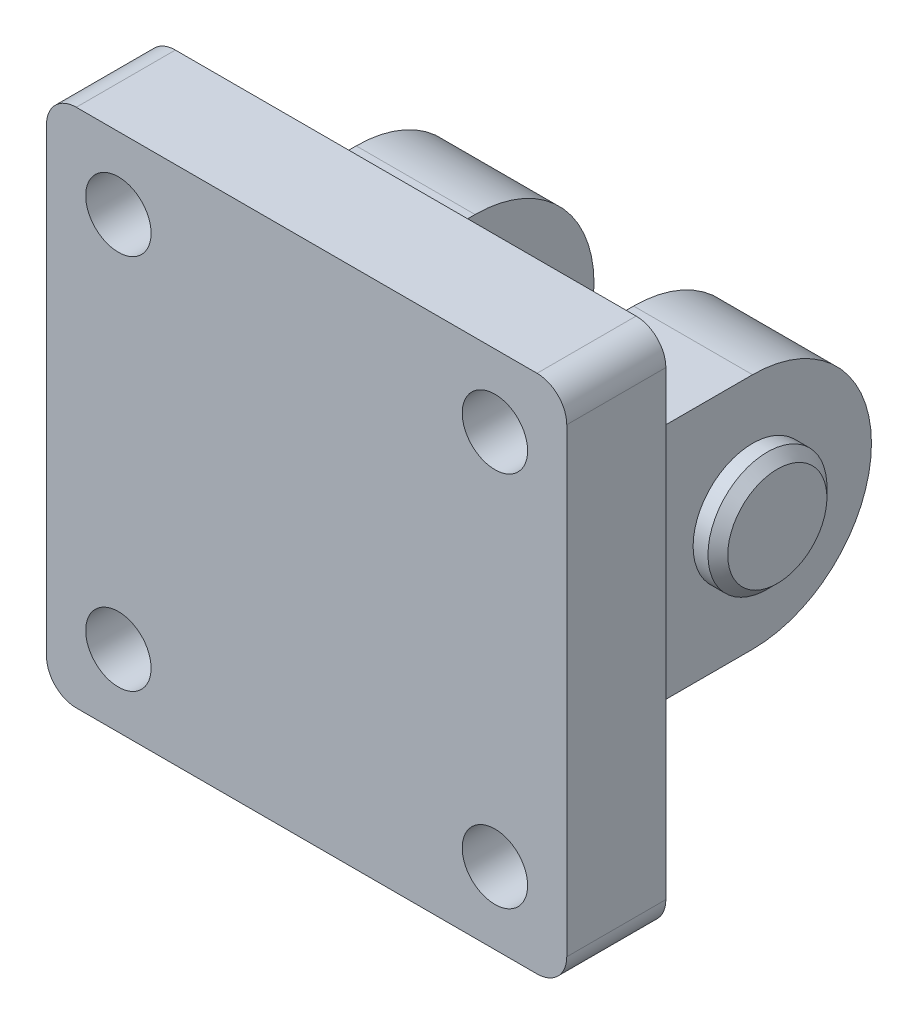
ISO-10303-21;
HEADER;
FILE_DESCRIPTION(('STEP AP214'),'2;1');
FILE_NAME('part.step','',(''),(''),'','','');
FILE_SCHEMA(('AUTOMOTIVE_DESIGN { 1 0 10303 214 1 1 1 1 }'));
ENDSEC;
DATA;
#1=APPLICATION_CONTEXT('core data for automotive mechanical design processes');
#2=APPLICATION_PROTOCOL_DEFINITION('international standard','automotive_design',2000,#1);
#3=PRODUCT_CONTEXT('',#1,'mechanical');
#4=PRODUCT('Part','Part','',(#3));
#5=PRODUCT_RELATED_PRODUCT_CATEGORY('part','',(#4));
#6=PRODUCT_DEFINITION_FORMATION('','',#4);
#7=PRODUCT_DEFINITION_CONTEXT('part definition',#1,'design');
#8=PRODUCT_DEFINITION('design','',#6,#7);
#9=PRODUCT_DEFINITION_SHAPE('','',#8);
#10=(LENGTH_UNIT() NAMED_UNIT(*) SI_UNIT(.MILLI.,.METRE.));
#11=(NAMED_UNIT(*) PLANE_ANGLE_UNIT() SI_UNIT($,.RADIAN.));
#12=(NAMED_UNIT(*) SI_UNIT($,.STERADIAN.) SOLID_ANGLE_UNIT());
#13=UNCERTAINTY_MEASURE_WITH_UNIT(LENGTH_MEASURE(1.E-05),#10,'distance_accuracy_value','');
#14=(GEOMETRIC_REPRESENTATION_CONTEXT(3) GLOBAL_UNCERTAINTY_ASSIGNED_CONTEXT((#13)) GLOBAL_UNIT_ASSIGNED_CONTEXT((#10,
#11,#12)) REPRESENTATION_CONTEXT('',''));
#15=CARTESIAN_POINT('',(0.,0.,0.));
#16=DIRECTION('',(0.,0.,1.));
#17=DIRECTION('',(1.,0.,0.));
#18=AXIS2_PLACEMENT_3D('',#15,#16,#17);
#19=CARTESIAN_POINT('',(22.5,0.,-25.));
#20=DIRECTION('',(1.,0.,0.));
#21=DIRECTION('',(0.,0.,-1.));
#22=AXIS2_PLACEMENT_3D('',#19,#20,#21);
#23=PLANE('',#22);
#24=CARTESIAN_POINT('',(22.4999999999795,0.,-25.));
#25=DIRECTION('',(-1.,0.,0.));
#26=DIRECTION('',(0.,0.,1.));
#27=AXIS2_PLACEMENT_3D('',#24,#25,#26);
#28=CIRCLE('',#27,5.00000000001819);
#29=CARTESIAN_POINT('',(22.4999999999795,0.,-19.9999999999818));
#30=VERTEX_POINT('',#29);
#31=EDGE_CURVE('E20',#30,#30,#28,.T.);
#32=ORIENTED_EDGE('',*,*,#31,.F.);
#33=EDGE_LOOP('',(#32));
#34=FACE_BOUND('',#33,.T.);
#35=ADVANCED_FACE('F16',(#34),#23,.T.);
#36=CARTESIAN_POINT('',(-22.5,0.,-25.));
#37=DIRECTION('',(1.,0.,0.));
#38=DIRECTION('',(0.,0.,-1.));
#39=AXIS2_PLACEMENT_3D('',#36,#37,#38);
#40=PLANE('',#39);
#41=CARTESIAN_POINT('',(-22.4999999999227,0.,-25.));
#42=DIRECTION('',(1.,0.,0.));
#43=DIRECTION('',(0.,0.,-1.));
#44=AXIS2_PLACEMENT_3D('',#41,#42,#43);
#45=CIRCLE('',#44,5.00000000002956);
#46=CARTESIAN_POINT('',(-22.4999999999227,0.,-30.0000000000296));
#47=VERTEX_POINT('',#46);
#48=EDGE_CURVE('E299',#47,#47,#45,.T.);
#49=ORIENTED_EDGE('',*,*,#48,.F.);
#50=EDGE_LOOP('',(#49));
#51=FACE_BOUND('',#50,.T.);
#52=ADVANCED_FACE('F377',(#51),#40,.F.);
#53=CARTESIAN_POINT('',(21.5000000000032,0.,-25.));
#54=DIRECTION('',(-1.,0.,0.));
#55=DIRECTION('',(0.,0.,1.));
#56=AXIS2_PLACEMENT_3D('',#53,#54,#55);
#57=CONICAL_SURFACE('',#56,6.00000000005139,0.78539816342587);
#58=ORIENTED_EDGE('',*,*,#31,.T.);
#59=EDGE_LOOP('',(#58));
#60=FACE_BOUND('',#59,.T.);
#61=CARTESIAN_POINT('',(21.5,0.,-25.));
#62=DIRECTION('',(-1.,0.,0.));
#63=DIRECTION('',(0.,0.,1.));
#64=AXIS2_PLACEMENT_3D('',#61,#62,#63);
#65=CIRCLE('',#64,6.);
#66=CARTESIAN_POINT('',(21.5,0.,-19.));
#67=VERTEX_POINT('',#66);
#68=EDGE_CURVE('E297',#67,#67,#65,.T.);
#69=ORIENTED_EDGE('',*,*,#68,.F.);
#70=EDGE_LOOP('',(#69));
#71=FACE_BOUND('',#70,.T.);
#72=ADVANCED_FACE('F373',(#60,#71),#57,.T.);
#73=CARTESIAN_POINT('',(-21.5000000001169,0.,-25.));
#74=DIRECTION('',(1.,0.,0.));
#75=DIRECTION('',(0.,0.,-1.));
#76=AXIS2_PLACEMENT_3D('',#73,#74,#75);
#77=CONICAL_SURFACE('',#76,5.99999999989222,0.78539816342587);
#78=CARTESIAN_POINT('',(-21.5,0.,-25.));
#79=DIRECTION('',(-1.,0.,0.));
#80=DIRECTION('',(0.,0.,1.));
#81=AXIS2_PLACEMENT_3D('',#78,#79,#80);
#82=CIRCLE('',#81,6.);
#83=CARTESIAN_POINT('',(-21.5,0.,-19.));
#84=VERTEX_POINT('',#83);
#85=EDGE_CURVE('E283',#84,#84,#82,.F.);
#86=ORIENTED_EDGE('',*,*,#85,.F.);
#87=EDGE_LOOP('',(#86));
#88=FACE_BOUND('',#87,.T.);
#89=ORIENTED_EDGE('',*,*,#48,.T.);
#90=EDGE_LOOP('',(#89));
#91=FACE_BOUND('',#90,.T.);
#92=ADVANCED_FACE('F735',(#88,#91),#77,.T.);
#93=CARTESIAN_POINT('',(22.5,0.,-25.));
#94=DIRECTION('',(-1.,0.,0.));
#95=DIRECTION('',(0.,0.,1.));
#96=AXIS2_PLACEMENT_3D('',#93,#94,#95);
#97=CYLINDRICAL_SURFACE('',#96,6.);
#98=CARTESIAN_POINT('',(8.,0.,-25.));
#99=DIRECTION('',(-1.,0.,0.));
#100=DIRECTION('',(0.,0.,1.));
#101=AXIS2_PLACEMENT_3D('',#98,#99,#100);
#102=CIRCLE('',#101,6.);
#103=CARTESIAN_POINT('',(8.,0.,-19.));
#104=VERTEX_POINT('',#103);
#105=EDGE_CURVE('E250',#104,#104,#102,.F.);
#106=ORIENTED_EDGE('',*,*,#105,.F.);
#107=EDGE_LOOP('',(#106));
#108=FACE_BOUND('',#107,.T.);
#109=CARTESIAN_POINT('',(-8.,0.,-25.));
#110=DIRECTION('',(-1.,0.,0.));
#111=DIRECTION('',(0.,0.,1.));
#112=AXIS2_PLACEMENT_3D('',#109,#110,#111);
#113=CIRCLE('',#112,6.);
#114=CARTESIAN_POINT('',(-8.,0.,-19.));
#115=VERTEX_POINT('',#114);
#116=EDGE_CURVE('E286',#115,#115,#113,.T.);
#117=ORIENTED_EDGE('',*,*,#116,.F.);
#118=EDGE_LOOP('',(#117));
#119=FACE_BOUND('',#118,.T.);
#120=ADVANCED_FACE('F727',(#108,#119),#97,.T.);
#121=CARTESIAN_POINT('',(22.5,0.,-25.));
#122=DIRECTION('',(-1.,0.,0.));
#123=DIRECTION('',(0.,0.,1.));
#124=AXIS2_PLACEMENT_3D('',#121,#122,#123);
#125=CYLINDRICAL_SURFACE('',#124,6.);
#126=ORIENTED_EDGE('',*,*,#68,.T.);
#127=EDGE_LOOP('',(#126));
#128=FACE_BOUND('',#127,.T.);
#129=CARTESIAN_POINT('',(20.,0.,-25.));
#130=DIRECTION('',(-1.,0.,0.));
#131=DIRECTION('',(0.,0.,1.));
#132=AXIS2_PLACEMENT_3D('',#129,#130,#131);
#133=CIRCLE('',#132,6.);
#134=CARTESIAN_POINT('',(20.,0.,-19.));
#135=VERTEX_POINT('',#134);
#136=EDGE_CURVE('E255',#135,#135,#133,.F.);
#137=ORIENTED_EDGE('',*,*,#136,.T.);
#138=EDGE_LOOP('',(#137));
#139=FACE_BOUND('',#138,.T.);
#140=ADVANCED_FACE('F720',(#128,#139),#125,.T.);
#141=CARTESIAN_POINT('',(20.,-12.,-10.));
#142=DIRECTION('',(0.,0.,-1.));
#143=DIRECTION('',(0.,1.,0.));
#144=AXIS2_PLACEMENT_3D('',#141,#142,#143);
#145=PLANE('',#144);
#146=DIRECTION('',(0.,1.,0.));
#147=VECTOR('',#146,1.);
#148=CARTESIAN_POINT('',(10.,0.,-10.));
#149=LINE('',#148,#147);
#150=CARTESIAN_POINT('',(10.,-12.,-10.));
#151=VERTEX_POINT('',#150);
#152=CARTESIAN_POINT('',(10.,12.,-10.));
#153=VERTEX_POINT('',#152);
#154=EDGE_CURVE('E136',#151,#153,#149,.T.);
#155=ORIENTED_EDGE('',*,*,#154,.T.);
#156=DIRECTION('',(1.,0.,0.));
#157=VECTOR('',#156,1.);
#158=CARTESIAN_POINT('',(20.,12.,-10.));
#159=LINE('',#158,#157);
#160=CARTESIAN_POINT('',(8.,12.,-10.));
#161=VERTEX_POINT('',#160);
#162=EDGE_CURVE('E271',#153,#161,#159,.F.);
#163=ORIENTED_EDGE('',*,*,#162,.T.);
#164=DIRECTION('',(0.,1.,0.));
#165=VECTOR('',#164,1.);
#166=CARTESIAN_POINT('',(8.,0.,-10.));
#167=LINE('',#166,#165);
#168=CARTESIAN_POINT('',(8.,-12.,-10.));
#169=VERTEX_POINT('',#168);
#170=EDGE_CURVE('E247',#169,#161,#167,.T.);
#171=ORIENTED_EDGE('',*,*,#170,.F.);
#172=DIRECTION('',(1.,0.,0.));
#173=VECTOR('',#172,1.);
#174=CARTESIAN_POINT('',(20.,-12.,-10.));
#175=LINE('',#174,#173);
#176=EDGE_CURVE('E253',#169,#151,#175,.T.);
#177=ORIENTED_EDGE('',*,*,#176,.T.);
#178=EDGE_LOOP('',(#155,#163,#171,#177));
#179=FACE_BOUND('',#178,.T.);
#180=ADVANCED_FACE('F553',(#179),#145,.F.);
#181=CARTESIAN_POINT('',(20.,0.,-25.));
#182=DIRECTION('',(-1.,0.,0.));
#183=DIRECTION('',(0.,0.,1.));
#184=AXIS2_PLACEMENT_3D('',#181,#182,#183);
#185=CYLINDRICAL_SURFACE('',#184,12.);
#186=CARTESIAN_POINT('',(20.,0.,-25.));
#187=DIRECTION('',(-1.,0.,0.));
#188=DIRECTION('',(0.,0.,1.));
#189=AXIS2_PLACEMENT_3D('',#186,#187,#188);
#190=CIRCLE('',#189,12.);
#191=CARTESIAN_POINT('',(20.,12.,-25.));
#192=VERTEX_POINT('',#191);
#193=CARTESIAN_POINT('',(20.,-12.,-25.));
#194=VERTEX_POINT('',#193);
#195=EDGE_CURVE('E277',#192,#194,#190,.T.);
#196=ORIENTED_EDGE('',*,*,#195,.T.);
#197=DIRECTION('',(1.,0.,0.));
#198=VECTOR('',#197,1.);
#199=CARTESIAN_POINT('',(20.,-12.,-25.));
#200=LINE('',#199,#198);
#201=CARTESIAN_POINT('',(8.,-12.,-25.));
#202=VERTEX_POINT('',#201);
#203=EDGE_CURVE('E238',#194,#202,#200,.F.);
#204=ORIENTED_EDGE('',*,*,#203,.T.);
#205=CARTESIAN_POINT('',(8.,0.,-25.));
#206=DIRECTION('',(-1.,0.,0.));
#207=DIRECTION('',(0.,0.,1.));
#208=AXIS2_PLACEMENT_3D('',#205,#206,#207);
#209=CIRCLE('',#208,12.);
#210=CARTESIAN_POINT('',(8.,12.,-25.));
#211=VERTEX_POINT('',#210);
#212=EDGE_CURVE('E127',#211,#202,#209,.T.);
#213=ORIENTED_EDGE('',*,*,#212,.F.);
#214=DIRECTION('',(1.,0.,0.));
#215=VECTOR('',#214,1.);
#216=CARTESIAN_POINT('',(20.,12.,-25.));
#217=LINE('',#216,#215);
#218=EDGE_CURVE('E206',#211,#192,#217,.T.);
#219=ORIENTED_EDGE('',*,*,#218,.T.);
#220=EDGE_LOOP('',(#196,#204,#213,#219));
#221=FACE_BOUND('',#220,.T.);
#222=ADVANCED_FACE('F557',(#221),#185,.T.);
#223=CARTESIAN_POINT('',(8.,0.,-25.));
#224=DIRECTION('',(-1.,0.,0.));
#225=DIRECTION('',(0.,0.,1.));
#226=AXIS2_PLACEMENT_3D('',#223,#224,#225);
#227=PLANE('',#226);
#228=ORIENTED_EDGE('',*,*,#105,.T.);
#229=EDGE_LOOP('',(#228));
#230=FACE_BOUND('',#229,.T.);
#231=DIRECTION('',(0.,0.,1.));
#232=VECTOR('',#231,1.);
#233=CARTESIAN_POINT('',(8.,-12.,-25.));
#234=LINE('',#233,#232);
#235=EDGE_CURVE('E240',#202,#169,#234,.T.);
#236=ORIENTED_EDGE('',*,*,#235,.T.);
#237=ORIENTED_EDGE('',*,*,#170,.T.);
#238=DIRECTION('',(0.,0.,-1.));
#239=VECTOR('',#238,1.);
#240=CARTESIAN_POINT('',(8.,12.,-10.));
#241=LINE('',#240,#239);
#242=EDGE_CURVE('E275',#161,#211,#241,.T.);
#243=ORIENTED_EDGE('',*,*,#242,.T.);
#244=ORIENTED_EDGE('',*,*,#212,.T.);
#245=EDGE_LOOP('',(#236,#237,#243,#244));
#246=FACE_BOUND('',#245,.T.);
#247=ADVANCED_FACE('F556',(#230,#246),#227,.T.);
#248=CARTESIAN_POINT('',(10.,0.,-25.));
#249=DIRECTION('',(1.,0.,0.));
#250=DIRECTION('',(0.,0.,-1.));
#251=AXIS2_PLACEMENT_3D('',#248,#249,#250);
#252=PLANE('',#251);
#253=DIRECTION('',(0.,1.,0.));
#254=VECTOR('',#253,1.);
#255=CARTESIAN_POINT('',(10.,0.,-10.));
#256=LINE('',#255,#254);
#257=CARTESIAN_POINT('',(10.,13.2287565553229,-10.));
#258=VERTEX_POINT('',#257);
#259=EDGE_CURVE('E293',#153,#258,#256,.T.);
#260=ORIENTED_EDGE('',*,*,#259,.F.);
#261=ORIENTED_EDGE('',*,*,#154,.F.);
#262=DIRECTION('',(0.,1.,0.));
#263=VECTOR('',#262,1.);
#264=CARTESIAN_POINT('',(10.,0.,-10.));
#265=LINE('',#264,#263);
#266=CARTESIAN_POINT('',(10.,-13.2287565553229,-10.));
#267=VERTEX_POINT('',#266);
#268=EDGE_CURVE('E294',#267,#151,#265,.T.);
#269=ORIENTED_EDGE('',*,*,#268,.F.);
#270=CARTESIAN_POINT('',(10.,0.,-25.));
#271=DIRECTION('',(1.,0.,0.));
#272=DIRECTION('',(0.,0.,-1.));
#273=AXIS2_PLACEMENT_3D('',#270,#271,#272);
#274=CIRCLE('',#273,20.);
#275=EDGE_CURVE('E244',#267,#258,#274,.F.);
#276=ORIENTED_EDGE('',*,*,#275,.T.);
#277=EDGE_LOOP('',(#260,#261,#269,#276));
#278=FACE_BOUND('',#277,.T.);
#279=ADVANCED_FACE('F526',(#278),#252,.F.);
#280=CARTESIAN_POINT('',(-10.,0.,-25.));
#281=DIRECTION('',(1.,0.,0.));
#282=DIRECTION('',(0.,0.,-1.));
#283=AXIS2_PLACEMENT_3D('',#280,#281,#282);
#284=PLANE('',#283);
#285=DIRECTION('',(0.,1.,0.));
#286=VECTOR('',#285,1.);
#287=CARTESIAN_POINT('',(-10.,0.,-10.));
#288=LINE('',#287,#286);
#289=CARTESIAN_POINT('',(-10.,12.,-10.));
#290=VERTEX_POINT('',#289);
#291=CARTESIAN_POINT('',(-10.,13.2287565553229,-10.));
#292=VERTEX_POINT('',#291);
#293=EDGE_CURVE('E186',#290,#292,#288,.T.);
#294=ORIENTED_EDGE('',*,*,#293,.T.);
#295=CARTESIAN_POINT('',(-10.,0.,-25.));
#296=DIRECTION('',(1.,0.,0.));
#297=DIRECTION('',(0.,0.,-1.));
#298=AXIS2_PLACEMENT_3D('',#295,#296,#297);
#299=CIRCLE('',#298,20.);
#300=CARTESIAN_POINT('',(-10.,-13.2287565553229,-10.));
#301=VERTEX_POINT('',#300);
#302=EDGE_CURVE('E225',#292,#301,#299,.T.);
#303=ORIENTED_EDGE('',*,*,#302,.T.);
#304=DIRECTION('',(0.,1.,0.));
#305=VECTOR('',#304,1.);
#306=CARTESIAN_POINT('',(-10.,0.,-10.));
#307=LINE('',#306,#305);
#308=CARTESIAN_POINT('',(-10.,-12.,-10.));
#309=VERTEX_POINT('',#308);
#310=EDGE_CURVE('E511',#301,#309,#307,.T.);
#311=ORIENTED_EDGE('',*,*,#310,.T.);
#312=DIRECTION('',(0.,-1.,0.));
#313=VECTOR('',#312,1.);
#314=CARTESIAN_POINT('',(-10.,-12.,-10.));
#315=LINE('',#314,#313);
#316=EDGE_CURVE('E207',#290,#309,#315,.T.);
#317=ORIENTED_EDGE('',*,*,#316,.F.);
#318=EDGE_LOOP('',(#294,#303,#311,#317));
#319=FACE_BOUND('',#318,.T.);
#320=ADVANCED_FACE('F532',(#319),#284,.T.);
#321=CARTESIAN_POINT('',(22.5,0.,-25.));
#322=DIRECTION('',(-1.,0.,0.));
#323=DIRECTION('',(0.,0.,1.));
#324=AXIS2_PLACEMENT_3D('',#321,#322,#323);
#325=CYLINDRICAL_SURFACE('',#324,6.);
#326=ORIENTED_EDGE('',*,*,#85,.T.);
#327=EDGE_LOOP('',(#326));
#328=FACE_BOUND('',#327,.T.);
#329=CARTESIAN_POINT('',(-20.,0.,-25.));
#330=DIRECTION('',(-1.,0.,0.));
#331=DIRECTION('',(0.,0.,1.));
#332=AXIS2_PLACEMENT_3D('',#329,#330,#331);
#333=CIRCLE('',#332,6.);
#334=CARTESIAN_POINT('',(-20.,0.,-19.));
#335=VERTEX_POINT('',#334);
#336=EDGE_CURVE('E200',#335,#335,#333,.T.);
#337=ORIENTED_EDGE('',*,*,#336,.T.);
#338=EDGE_LOOP('',(#337));
#339=FACE_BOUND('',#338,.T.);
#340=ADVANCED_FACE('F587',(#328,#339),#325,.T.);
#341=CARTESIAN_POINT('',(-8.,0.,-25.));
#342=DIRECTION('',(1.,0.,0.));
#343=DIRECTION('',(0.,0.,-1.));
#344=AXIS2_PLACEMENT_3D('',#341,#342,#343);
#345=PLANE('',#344);
#346=ORIENTED_EDGE('',*,*,#116,.T.);
#347=EDGE_LOOP('',(#346));
#348=FACE_BOUND('',#347,.T.);
#349=DIRECTION('',(0.,0.,-1.));
#350=VECTOR('',#349,1.);
#351=CARTESIAN_POINT('',(-8.,-12.,-25.));
#352=LINE('',#351,#350);
#353=CARTESIAN_POINT('',(-8.,-12.,-25.));
#354=VERTEX_POINT('',#353);
#355=CARTESIAN_POINT('',(-8.,-12.,-10.));
#356=VERTEX_POINT('',#355);
#357=EDGE_CURVE('E222',#354,#356,#352,.F.);
#358=ORIENTED_EDGE('',*,*,#357,.F.);
#359=CARTESIAN_POINT('',(-8.,0.,-25.));
#360=DIRECTION('',(1.,0.,0.));
#361=DIRECTION('',(0.,0.,-1.));
#362=AXIS2_PLACEMENT_3D('',#359,#360,#361);
#363=CIRCLE('',#362,12.);
#364=CARTESIAN_POINT('',(-8.,12.,-25.));
#365=VERTEX_POINT('',#364);
#366=EDGE_CURVE('E289',#365,#354,#363,.F.);
#367=ORIENTED_EDGE('',*,*,#366,.F.);
#368=DIRECTION('',(0.,0.,1.));
#369=VECTOR('',#368,1.);
#370=CARTESIAN_POINT('',(-8.,12.,-10.));
#371=LINE('',#370,#369);
#372=CARTESIAN_POINT('',(-8.,12.,-10.));
#373=VERTEX_POINT('',#372);
#374=EDGE_CURVE('E198',#373,#365,#371,.F.);
#375=ORIENTED_EDGE('',*,*,#374,.F.);
#376=DIRECTION('',(0.,-1.,0.));
#377=VECTOR('',#376,1.);
#378=CARTESIAN_POINT('',(-8.,-12.,-10.));
#379=LINE('',#378,#377);
#380=EDGE_CURVE('E203',#356,#373,#379,.F.);
#381=ORIENTED_EDGE('',*,*,#380,.F.);
#382=EDGE_LOOP('',(#358,#367,#375,#381));
#383=FACE_BOUND('',#382,.T.);
#384=ADVANCED_FACE('F539',(#348,#383),#345,.T.);
#385=CARTESIAN_POINT('',(-20.,0.,-25.));
#386=DIRECTION('',(1.,0.,0.));
#387=DIRECTION('',(0.,0.,-1.));
#388=AXIS2_PLACEMENT_3D('',#385,#386,#387);
#389=CYLINDRICAL_SURFACE('',#388,12.);
#390=DIRECTION('',(1.,0.,0.));
#391=VECTOR('',#390,1.);
#392=CARTESIAN_POINT('',(-20.,12.,-25.));
#393=LINE('',#392,#391);
#394=CARTESIAN_POINT('',(-20.,12.,-25.));
#395=VERTEX_POINT('',#394);
#396=EDGE_CURVE('E181',#365,#395,#393,.F.);
#397=ORIENTED_EDGE('',*,*,#396,.F.);
#398=ORIENTED_EDGE('',*,*,#366,.T.);
#399=DIRECTION('',(1.,0.,0.));
#400=VECTOR('',#399,1.);
#401=CARTESIAN_POINT('',(-20.,-12.,-25.));
#402=LINE('',#401,#400);
#403=CARTESIAN_POINT('',(-20.,-12.,-25.));
#404=VERTEX_POINT('',#403);
#405=EDGE_CURVE('E214',#404,#354,#402,.T.);
#406=ORIENTED_EDGE('',*,*,#405,.F.);
#407=CARTESIAN_POINT('',(-20.,0.,-25.));
#408=DIRECTION('',(1.,0.,0.));
#409=DIRECTION('',(0.,0.,-1.));
#410=AXIS2_PLACEMENT_3D('',#407,#408,#409);
#411=CIRCLE('',#410,12.);
#412=EDGE_CURVE('E352',#404,#395,#411,.T.);
#413=ORIENTED_EDGE('',*,*,#412,.T.);
#414=EDGE_LOOP('',(#397,#398,#406,#413));
#415=FACE_BOUND('',#414,.T.);
#416=ADVANCED_FACE('F542',(#415),#389,.T.);
#417=CARTESIAN_POINT('',(-20.,-12.,-10.));
#418=DIRECTION('',(0.,0.,1.));
#419=DIRECTION('',(0.,-1.,0.));
#420=AXIS2_PLACEMENT_3D('',#417,#418,#419);
#421=PLANE('',#420);
#422=DIRECTION('',(1.,0.,0.));
#423=VECTOR('',#422,1.);
#424=CARTESIAN_POINT('',(-20.,-12.,-10.));
#425=LINE('',#424,#423);
#426=EDGE_CURVE('E217',#356,#309,#425,.F.);
#427=ORIENTED_EDGE('',*,*,#426,.F.);
#428=ORIENTED_EDGE('',*,*,#380,.T.);
#429=DIRECTION('',(1.,0.,0.));
#430=VECTOR('',#429,1.);
#431=CARTESIAN_POINT('',(-20.,12.,-10.));
#432=LINE('',#431,#430);
#433=EDGE_CURVE('E182',#290,#373,#432,.T.);
#434=ORIENTED_EDGE('',*,*,#433,.F.);
#435=ORIENTED_EDGE('',*,*,#316,.T.);
#436=EDGE_LOOP('',(#427,#428,#434,#435));
#437=FACE_BOUND('',#436,.T.);
#438=ADVANCED_FACE('F536',(#437),#421,.T.);
#439=CARTESIAN_POINT('',(20.,12.,-10.));
#440=DIRECTION('',(0.,-1.,0.));
#441=DIRECTION('',(0.,0.,-1.));
#442=AXIS2_PLACEMENT_3D('',#439,#440,#441);
#443=PLANE('',#442);
#444=ORIENTED_EDGE('',*,*,#162,.F.);
#445=DIRECTION('',(1.,0.,0.));
#446=VECTOR('',#445,1.);
#447=CARTESIAN_POINT('',(-26.25,12.,-10.));
#448=LINE('',#447,#446);
#449=CARTESIAN_POINT('',(20.,12.,-10.));
#450=VERTEX_POINT('',#449);
#451=EDGE_CURVE('E234',#153,#450,#448,.T.);
#452=ORIENTED_EDGE('',*,*,#451,.T.);
#453=DIRECTION('',(0.,0.,1.));
#454=VECTOR('',#453,1.);
#455=CARTESIAN_POINT('',(20.,12.,-25.));
#456=LINE('',#455,#454);
#457=EDGE_CURVE('E360',#450,#192,#456,.F.);
#458=ORIENTED_EDGE('',*,*,#457,.T.);
#459=ORIENTED_EDGE('',*,*,#218,.F.);
#460=ORIENTED_EDGE('',*,*,#242,.F.);
#461=EDGE_LOOP('',(#444,#452,#458,#459,#460));
#462=FACE_BOUND('',#461,.T.);
#463=ADVANCED_FACE('F564',(#462),#443,.F.);
#464=CARTESIAN_POINT('',(20.,0.,-25.));
#465=DIRECTION('',(-1.,0.,0.));
#466=DIRECTION('',(0.,0.,1.));
#467=AXIS2_PLACEMENT_3D('',#464,#465,#466);
#468=PLANE('',#467);
#469=ORIENTED_EDGE('',*,*,#136,.F.);
#470=EDGE_LOOP('',(#469));
#471=FACE_BOUND('',#470,.T.);
#472=DIRECTION('',(0.,1.,0.));
#473=VECTOR('',#472,1.);
#474=CARTESIAN_POINT('',(20.,-26.25,-10.));
#475=LINE('',#474,#473);
#476=CARTESIAN_POINT('',(20.,-12.,-10.));
#477=VERTEX_POINT('',#476);
#478=EDGE_CURVE('E262',#450,#477,#475,.F.);
#479=ORIENTED_EDGE('',*,*,#478,.T.);
#480=DIRECTION('',(0.,0.,1.));
#481=VECTOR('',#480,1.);
#482=CARTESIAN_POINT('',(20.,-12.,-25.));
#483=LINE('',#482,#481);
#484=EDGE_CURVE('E241',#477,#194,#483,.F.);
#485=ORIENTED_EDGE('',*,*,#484,.T.);
#486=ORIENTED_EDGE('',*,*,#195,.F.);
#487=ORIENTED_EDGE('',*,*,#457,.F.);
#488=EDGE_LOOP('',(#479,#485,#486,#487));
#489=FACE_BOUND('',#488,.T.);
#490=ADVANCED_FACE('F562',(#471,#489),#468,.F.);
#491=CARTESIAN_POINT('',(20.,-12.,-25.));
#492=DIRECTION('',(0.,1.,0.));
#493=DIRECTION('',(0.,0.,1.));
#494=AXIS2_PLACEMENT_3D('',#491,#492,#493);
#495=PLANE('',#494);
#496=ORIENTED_EDGE('',*,*,#203,.F.);
#497=ORIENTED_EDGE('',*,*,#484,.F.);
#498=DIRECTION('',(1.,0.,0.));
#499=VECTOR('',#498,1.);
#500=CARTESIAN_POINT('',(-26.25,-12.,-10.));
#501=LINE('',#500,#499);
#502=EDGE_CURVE('E237',#477,#151,#501,.F.);
#503=ORIENTED_EDGE('',*,*,#502,.T.);
#504=ORIENTED_EDGE('',*,*,#176,.F.);
#505=ORIENTED_EDGE('',*,*,#235,.F.);
#506=EDGE_LOOP('',(#496,#497,#503,#504,#505));
#507=FACE_BOUND('',#506,.T.);
#508=ADVANCED_FACE('F550',(#507),#495,.F.);
#509=CARTESIAN_POINT('',(-10.,0.,-25.));
#510=DIRECTION('',(1.,0.,0.));
#511=DIRECTION('',(0.,0.,-1.));
#512=AXIS2_PLACEMENT_3D('',#509,#510,#511);
#513=CYLINDRICAL_SURFACE('',#512,20.);
#514=DIRECTION('',(1.,0.,0.));
#515=VECTOR('',#514,1.);
#516=CARTESIAN_POINT('',(-26.25,13.2287565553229,-10.));
#517=LINE('',#516,#515);
#518=EDGE_CURVE('E211',#292,#258,#517,.T.);
#519=ORIENTED_EDGE('',*,*,#518,.T.);
#520=ORIENTED_EDGE('',*,*,#275,.F.);
#521=DIRECTION('',(1.,0.,0.));
#522=VECTOR('',#521,1.);
#523=CARTESIAN_POINT('',(-26.25,-13.2287565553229,-10.));
#524=LINE('',#523,#522);
#525=EDGE_CURVE('E219',#267,#301,#524,.F.);
#526=ORIENTED_EDGE('',*,*,#525,.T.);
#527=ORIENTED_EDGE('',*,*,#302,.F.);
#528=EDGE_LOOP('',(#519,#520,#526,#527));
#529=FACE_BOUND('',#528,.T.);
#530=ADVANCED_FACE('F530',(#529),#513,.F.);
#531=CARTESIAN_POINT('',(-20.,-12.,-25.));
#532=DIRECTION('',(0.,-1.,0.));
#533=DIRECTION('',(0.,0.,-1.));
#534=AXIS2_PLACEMENT_3D('',#531,#532,#533);
#535=PLANE('',#534);
#536=DIRECTION('',(0.,0.,-1.));
#537=VECTOR('',#536,1.);
#538=CARTESIAN_POINT('',(-20.,-12.,-25.));
#539=LINE('',#538,#537);
#540=CARTESIAN_POINT('',(-20.,-12.,-10.));
#541=VERTEX_POINT('',#540);
#542=EDGE_CURVE('E168',#541,#404,#539,.T.);
#543=ORIENTED_EDGE('',*,*,#542,.T.);
#544=ORIENTED_EDGE('',*,*,#405,.T.);
#545=ORIENTED_EDGE('',*,*,#357,.T.);
#546=ORIENTED_EDGE('',*,*,#426,.T.);
#547=DIRECTION('',(1.,0.,0.));
#548=VECTOR('',#547,1.);
#549=CARTESIAN_POINT('',(-26.25,-12.,-10.));
#550=LINE('',#549,#548);
#551=EDGE_CURVE('E173',#309,#541,#550,.F.);
#552=ORIENTED_EDGE('',*,*,#551,.T.);
#553=EDGE_LOOP('',(#543,#544,#545,#546,#552));
#554=FACE_BOUND('',#553,.T.);
#555=ADVANCED_FACE('F544',(#554),#535,.T.);
#556=CARTESIAN_POINT('',(-20.,0.,-25.));
#557=DIRECTION('',(1.,0.,0.));
#558=DIRECTION('',(0.,0.,-1.));
#559=AXIS2_PLACEMENT_3D('',#556,#557,#558);
#560=PLANE('',#559);
#561=ORIENTED_EDGE('',*,*,#336,.F.);
#562=EDGE_LOOP('',(#561));
#563=FACE_BOUND('',#562,.T.);
#564=ORIENTED_EDGE('',*,*,#412,.F.);
#565=ORIENTED_EDGE('',*,*,#542,.F.);
#566=DIRECTION('',(0.,1.,0.));
#567=VECTOR('',#566,1.);
#568=CARTESIAN_POINT('',(-20.,-26.25,-10.));
#569=LINE('',#568,#567);
#570=CARTESIAN_POINT('',(-20.,12.,-10.));
#571=VERTEX_POINT('',#570);
#572=EDGE_CURVE('E162',#541,#571,#569,.T.);
#573=ORIENTED_EDGE('',*,*,#572,.T.);
#574=DIRECTION('',(0.,0.,1.));
#575=VECTOR('',#574,1.);
#576=CARTESIAN_POINT('',(-20.,12.,-10.));
#577=LINE('',#576,#575);
#578=EDGE_CURVE('E165',#395,#571,#577,.T.);
#579=ORIENTED_EDGE('',*,*,#578,.F.);
#580=EDGE_LOOP('',(#564,#565,#573,#579));
#581=FACE_BOUND('',#580,.T.);
#582=ADVANCED_FACE('F164',(#563,#581),#560,.F.);
#583=CARTESIAN_POINT('',(-20.,12.,-10.));
#584=DIRECTION('',(0.,1.,0.));
#585=DIRECTION('',(0.,0.,1.));
#586=AXIS2_PLACEMENT_3D('',#583,#584,#585);
#587=PLANE('',#586);
#588=DIRECTION('',(1.,0.,0.));
#589=VECTOR('',#588,1.);
#590=CARTESIAN_POINT('',(-26.25,12.,-10.));
#591=LINE('',#590,#589);
#592=EDGE_CURVE('E172',#571,#290,#591,.T.);
#593=ORIENTED_EDGE('',*,*,#592,.T.);
#594=ORIENTED_EDGE('',*,*,#433,.T.);
#595=ORIENTED_EDGE('',*,*,#374,.T.);
#596=ORIENTED_EDGE('',*,*,#396,.T.);
#597=ORIENTED_EDGE('',*,*,#578,.T.);
#598=EDGE_LOOP('',(#593,#594,#595,#596,#597));
#599=FACE_BOUND('',#598,.T.);
#600=ADVANCED_FACE('F177',(#599),#587,.T.);
#601=CARTESIAN_POINT('',(-26.25,-26.25,-10.));
#602=DIRECTION('',(0.,0.,1.));
#603=DIRECTION('',(1.,0.,0.));
#604=AXIS2_PLACEMENT_3D('',#601,#602,#603);
#605=PLANE('',#604);
#606=CARTESIAN_POINT('',(-23.25,-23.25,-10.));
#607=DIRECTION('',(0.,0.,1.));
#608=DIRECTION('',(1.,0.,0.));
#609=AXIS2_PLACEMENT_3D('',#606,#607,#608);
#610=CIRCLE('',#609,3.);
#611=CARTESIAN_POINT('',(-26.25,-23.25,-10.));
#612=VERTEX_POINT('',#611);
#613=CARTESIAN_POINT('',(-23.25,-26.25,-10.));
#614=VERTEX_POINT('',#613);
#615=EDGE_CURVE('E338',#612,#614,#610,.T.);
#616=ORIENTED_EDGE('',*,*,#615,.F.);
#617=DIRECTION('',(0.,-1.,0.));
#618=VECTOR('',#617,1.);
#619=CARTESIAN_POINT('',(-26.25,26.25,-10.));
#620=LINE('',#619,#618);
#621=CARTESIAN_POINT('',(-26.25,23.25,-10.));
#622=VERTEX_POINT('',#621);
#623=EDGE_CURVE('E341',#622,#612,#620,.T.);
#624=ORIENTED_EDGE('',*,*,#623,.F.);
#625=CARTESIAN_POINT('',(-23.25,23.25,-10.));
#626=DIRECTION('',(0.,0.,1.));
#627=DIRECTION('',(1.,0.,0.));
#628=AXIS2_PLACEMENT_3D('',#625,#626,#627);
#629=CIRCLE('',#628,3.);
#630=CARTESIAN_POINT('',(-23.25,26.25,-10.));
#631=VERTEX_POINT('',#630);
#632=EDGE_CURVE('E325',#631,#622,#629,.T.);
#633=ORIENTED_EDGE('',*,*,#632,.F.);
#634=DIRECTION('',(1.,0.,0.));
#635=VECTOR('',#634,1.);
#636=CARTESIAN_POINT('',(-26.25,26.25,-10.));
#637=LINE('',#636,#635);
#638=CARTESIAN_POINT('',(23.25,26.25,-10.));
#639=VERTEX_POINT('',#638);
#640=EDGE_CURVE('E329',#639,#631,#637,.F.);
#641=ORIENTED_EDGE('',*,*,#640,.F.);
#642=CARTESIAN_POINT('',(23.25,23.25,-10.));
#643=DIRECTION('',(0.,0.,1.));
#644=DIRECTION('',(1.,0.,0.));
#645=AXIS2_PLACEMENT_3D('',#642,#643,#644);
#646=CIRCLE('',#645,3.);
#647=CARTESIAN_POINT('',(26.25,23.25,-10.));
#648=VERTEX_POINT('',#647);
#649=EDGE_CURVE('E330',#648,#639,#646,.T.);
#650=ORIENTED_EDGE('',*,*,#649,.F.);
#651=DIRECTION('',(0.,1.,0.));
#652=VECTOR('',#651,1.);
#653=CARTESIAN_POINT('',(26.25,26.25,-10.));
#654=LINE('',#653,#652);
#655=CARTESIAN_POINT('',(26.25,-23.25,-10.));
#656=VERTEX_POINT('',#655);
#657=EDGE_CURVE('E333',#656,#648,#654,.T.);
#658=ORIENTED_EDGE('',*,*,#657,.F.);
#659=CARTESIAN_POINT('',(23.25,-23.25,-10.));
#660=DIRECTION('',(0.,0.,1.));
#661=DIRECTION('',(1.,0.,0.));
#662=AXIS2_PLACEMENT_3D('',#659,#660,#661);
#663=CIRCLE('',#662,3.);
#664=CARTESIAN_POINT('',(23.25,-26.25,-10.));
#665=VERTEX_POINT('',#664);
#666=EDGE_CURVE('E334',#665,#656,#663,.T.);
#667=ORIENTED_EDGE('',*,*,#666,.F.);
#668=DIRECTION('',(1.,0.,0.));
#669=VECTOR('',#668,1.);
#670=CARTESIAN_POINT('',(-26.25,-26.25,-10.));
#671=LINE('',#670,#669);
#672=EDGE_CURVE('E337',#614,#665,#671,.T.);
#673=ORIENTED_EDGE('',*,*,#672,.F.);
#674=EDGE_LOOP('',(#616,#624,#633,#641,#650,#658,#667,#673));
#675=FACE_BOUND('',#674,.T.);
#676=CARTESIAN_POINT('',(-19.,19.,-10.));
#677=DIRECTION('',(0.,0.,1.));
#678=DIRECTION('',(1.,0.,0.));
#679=AXIS2_PLACEMENT_3D('',#676,#677,#678);
#680=CIRCLE('',#679,3.3);
#681=CARTESIAN_POINT('',(-15.7,19.,-10.));
#682=VERTEX_POINT('',#681);
#683=EDGE_CURVE('E342',#682,#682,#680,.T.);
#684=ORIENTED_EDGE('',*,*,#683,.T.);
#685=EDGE_LOOP('',(#684));
#686=FACE_BOUND('',#685,.T.);
#687=CARTESIAN_POINT('',(-19.,-19.,-10.));
#688=DIRECTION('',(0.,0.,1.));
#689=DIRECTION('',(1.,0.,0.));
#690=AXIS2_PLACEMENT_3D('',#687,#688,#689);
#691=CIRCLE('',#690,3.3);
#692=CARTESIAN_POINT('',(-15.7,-19.,-10.));
#693=VERTEX_POINT('',#692);
#694=EDGE_CURVE('E345',#693,#693,#691,.T.);
#695=ORIENTED_EDGE('',*,*,#694,.T.);
#696=EDGE_LOOP('',(#695));
#697=FACE_BOUND('',#696,.T.);
#698=CARTESIAN_POINT('',(19.,-19.,-10.));
#699=DIRECTION('',(0.,0.,1.));
#700=DIRECTION('',(1.,0.,0.));
#701=AXIS2_PLACEMENT_3D('',#698,#699,#700);
#702=CIRCLE('',#701,3.3);
#703=CARTESIAN_POINT('',(22.3,-19.,-10.));
#704=VERTEX_POINT('',#703);
#705=EDGE_CURVE('E191',#704,#704,#702,.T.);
#706=ORIENTED_EDGE('',*,*,#705,.T.);
#707=EDGE_LOOP('',(#706));
#708=FACE_BOUND('',#707,.T.);
#709=CARTESIAN_POINT('',(19.,19.,-10.));
#710=DIRECTION('',(0.,0.,1.));
#711=DIRECTION('',(1.,0.,0.));
#712=AXIS2_PLACEMENT_3D('',#709,#710,#711);
#713=CIRCLE('',#712,3.3);
#714=CARTESIAN_POINT('',(22.3,19.,-10.));
#715=VERTEX_POINT('',#714);
#716=EDGE_CURVE('E188',#715,#715,#713,.T.);
#717=ORIENTED_EDGE('',*,*,#716,.T.);
#718=EDGE_LOOP('',(#717));
#719=FACE_BOUND('',#718,.T.);
#720=ORIENTED_EDGE('',*,*,#592,.F.);
#721=ORIENTED_EDGE('',*,*,#572,.F.);
#722=ORIENTED_EDGE('',*,*,#551,.F.);
#723=ORIENTED_EDGE('',*,*,#310,.F.);
#724=ORIENTED_EDGE('',*,*,#525,.F.);
#725=ORIENTED_EDGE('',*,*,#268,.T.);
#726=ORIENTED_EDGE('',*,*,#502,.F.);
#727=ORIENTED_EDGE('',*,*,#478,.F.);
#728=ORIENTED_EDGE('',*,*,#451,.F.);
#729=ORIENTED_EDGE('',*,*,#259,.T.);
#730=ORIENTED_EDGE('',*,*,#518,.F.);
#731=ORIENTED_EDGE('',*,*,#293,.F.);
#732=EDGE_LOOP('',(#720,#721,#722,#723,#724,#725,#726,#727,#728,#729,#730,#731));
#733=FACE_BOUND('',#732,.T.);
#734=ADVANCED_FACE('F184',(#675,#686,#697,#708,#719,#733),#605,.F.);
#735=CARTESIAN_POINT('',(19.,19.,-10.));
#736=DIRECTION('',(0.,0.,1.));
#737=DIRECTION('',(1.,0.,0.));
#738=AXIS2_PLACEMENT_3D('',#735,#736,#737);
#739=CYLINDRICAL_SURFACE('',#738,3.3);
#740=CARTESIAN_POINT('',(19.,19.,0.));
#741=DIRECTION('',(0.,0.,1.));
#742=DIRECTION('',(1.,0.,0.));
#743=AXIS2_PLACEMENT_3D('',#740,#741,#742);
#744=CIRCLE('',#743,3.3);
#745=CARTESIAN_POINT('',(22.3,19.,0.));
#746=VERTEX_POINT('',#745);
#747=EDGE_CURVE('E322',#746,#746,#744,.F.);
#748=ORIENTED_EDGE('',*,*,#747,.F.);
#749=EDGE_LOOP('',(#748));
#750=FACE_BOUND('',#749,.T.);
#751=ORIENTED_EDGE('',*,*,#716,.F.);
#752=EDGE_LOOP('',(#751));
#753=FACE_BOUND('',#752,.T.);
#754=ADVANCED_FACE('F403',(#750,#753),#739,.F.);
#755=CARTESIAN_POINT('',(19.,-19.,-10.));
#756=DIRECTION('',(0.,0.,1.));
#757=DIRECTION('',(1.,0.,0.));
#758=AXIS2_PLACEMENT_3D('',#755,#756,#757);
#759=CYLINDRICAL_SURFACE('',#758,3.3);
#760=CARTESIAN_POINT('',(19.,-19.,0.));
#761=DIRECTION('',(0.,0.,1.));
#762=DIRECTION('',(1.,0.,0.));
#763=AXIS2_PLACEMENT_3D('',#760,#761,#762);
#764=CIRCLE('',#763,3.3);
#765=CARTESIAN_POINT('',(22.3,-19.,0.));
#766=VERTEX_POINT('',#765);
#767=EDGE_CURVE('E319',#766,#766,#764,.F.);
#768=ORIENTED_EDGE('',*,*,#767,.F.);
#769=EDGE_LOOP('',(#768));
#770=FACE_BOUND('',#769,.T.);
#771=ORIENTED_EDGE('',*,*,#705,.F.);
#772=EDGE_LOOP('',(#771));
#773=FACE_BOUND('',#772,.T.);
#774=ADVANCED_FACE('F406',(#770,#773),#759,.F.);
#775=CARTESIAN_POINT('',(-19.,-19.,-10.));
#776=DIRECTION('',(0.,0.,1.));
#777=DIRECTION('',(1.,0.,0.));
#778=AXIS2_PLACEMENT_3D('',#775,#776,#777);
#779=CYLINDRICAL_SURFACE('',#778,3.3);
#780=CARTESIAN_POINT('',(-19.,-19.,0.));
#781=DIRECTION('',(0.,0.,1.));
#782=DIRECTION('',(1.,0.,0.));
#783=AXIS2_PLACEMENT_3D('',#780,#781,#782);
#784=CIRCLE('',#783,3.3);
#785=CARTESIAN_POINT('',(-15.7,-19.,0.));
#786=VERTEX_POINT('',#785);
#787=EDGE_CURVE('E316',#786,#786,#784,.F.);
#788=ORIENTED_EDGE('',*,*,#787,.F.);
#789=EDGE_LOOP('',(#788));
#790=FACE_BOUND('',#789,.T.);
#791=ORIENTED_EDGE('',*,*,#694,.F.);
#792=EDGE_LOOP('',(#791));
#793=FACE_BOUND('',#792,.T.);
#794=ADVANCED_FACE('F422',(#790,#793),#779,.F.);
#795=CARTESIAN_POINT('',(-19.,19.,-10.));
#796=DIRECTION('',(0.,0.,1.));
#797=DIRECTION('',(1.,0.,0.));
#798=AXIS2_PLACEMENT_3D('',#795,#796,#797);
#799=CYLINDRICAL_SURFACE('',#798,3.3);
#800=CARTESIAN_POINT('',(-19.,19.,0.));
#801=DIRECTION('',(0.,0.,1.));
#802=DIRECTION('',(1.,0.,0.));
#803=AXIS2_PLACEMENT_3D('',#800,#801,#802);
#804=CIRCLE('',#803,3.3);
#805=CARTESIAN_POINT('',(-15.7,19.,0.));
#806=VERTEX_POINT('',#805);
#807=EDGE_CURVE('E313',#806,#806,#804,.F.);
#808=ORIENTED_EDGE('',*,*,#807,.F.);
#809=EDGE_LOOP('',(#808));
#810=FACE_BOUND('',#809,.T.);
#811=ORIENTED_EDGE('',*,*,#683,.F.);
#812=EDGE_LOOP('',(#811));
#813=FACE_BOUND('',#812,.T.);
#814=ADVANCED_FACE('F426',(#810,#813),#799,.F.);
#815=CARTESIAN_POINT('',(-26.25,26.25,-10.));
#816=DIRECTION('',(-1.,0.,0.));
#817=DIRECTION('',(0.,-1.,0.));
#818=AXIS2_PLACEMENT_3D('',#815,#816,#817);
#819=PLANE('',#818);
#820=DIRECTION('',(0.,1.,0.));
#821=VECTOR('',#820,1.);
#822=CARTESIAN_POINT('',(-26.25,-26.25,0.));
#823=LINE('',#822,#821);
#824=CARTESIAN_POINT('',(-26.25,23.25,0.));
#825=VERTEX_POINT('',#824);
#826=CARTESIAN_POINT('',(-26.25,-23.25,0.));
#827=VERTEX_POINT('',#826);
#828=EDGE_CURVE('E312',#825,#827,#823,.F.);
#829=ORIENTED_EDGE('',*,*,#828,.F.);
#830=DIRECTION('',(0.,0.,1.));
#831=VECTOR('',#830,1.);
#832=CARTESIAN_POINT('',(-26.25,23.25,-10.));
#833=LINE('',#832,#831);
#834=EDGE_CURVE('E328',#622,#825,#833,.T.);
#835=ORIENTED_EDGE('',*,*,#834,.F.);
#836=ORIENTED_EDGE('',*,*,#623,.T.);
#837=DIRECTION('',(0.,0.,1.));
#838=VECTOR('',#837,1.);
#839=CARTESIAN_POINT('',(-26.25,-23.25,-10.));
#840=LINE('',#839,#838);
#841=EDGE_CURVE('E340',#827,#612,#840,.F.);
#842=ORIENTED_EDGE('',*,*,#841,.F.);
#843=EDGE_LOOP('',(#829,#835,#836,#842));
#844=FACE_BOUND('',#843,.T.);
#845=ADVANCED_FACE('F430',(#844),#819,.T.);
#846=CARTESIAN_POINT('',(-23.25,-23.25,-10.));
#847=DIRECTION('',(0.,0.,1.));
#848=DIRECTION('',(1.,0.,0.));
#849=AXIS2_PLACEMENT_3D('',#846,#847,#848);
#850=CYLINDRICAL_SURFACE('',#849,3.);
#851=CARTESIAN_POINT('',(-23.25,-23.25,0.));
#852=DIRECTION('',(0.,0.,1.));
#853=DIRECTION('',(1.,0.,0.));
#854=AXIS2_PLACEMENT_3D('',#851,#852,#853);
#855=CIRCLE('',#854,3.);
#856=CARTESIAN_POINT('',(-23.25,-26.25,0.));
#857=VERTEX_POINT('',#856);
#858=EDGE_CURVE('E309',#827,#857,#855,.T.);
#859=ORIENTED_EDGE('',*,*,#858,.F.);
#860=ORIENTED_EDGE('',*,*,#841,.T.);
#861=ORIENTED_EDGE('',*,*,#615,.T.);
#862=DIRECTION('',(0.,0.,-1.));
#863=VECTOR('',#862,1.);
#864=CARTESIAN_POINT('',(-23.25,-26.25,-10.));
#865=LINE('',#864,#863);
#866=EDGE_CURVE('E475',#857,#614,#865,.T.);
#867=ORIENTED_EDGE('',*,*,#866,.F.);
#868=EDGE_LOOP('',(#859,#860,#861,#867));
#869=FACE_BOUND('',#868,.T.);
#870=ADVANCED_FACE('F434',(#869),#850,.T.);
#871=CARTESIAN_POINT('',(-26.25,-26.25,-10.));
#872=DIRECTION('',(0.,-1.,0.));
#873=DIRECTION('',(0.,0.,-1.));
#874=AXIS2_PLACEMENT_3D('',#871,#872,#873);
#875=PLANE('',#874);
#876=ORIENTED_EDGE('',*,*,#672,.T.);
#877=DIRECTION('',(0.,0.,1.));
#878=VECTOR('',#877,1.);
#879=CARTESIAN_POINT('',(23.25,-26.25,-10.));
#880=LINE('',#879,#878);
#881=CARTESIAN_POINT('',(23.25,-26.25,0.));
#882=VERTEX_POINT('',#881);
#883=EDGE_CURVE('E336',#882,#665,#880,.F.);
#884=ORIENTED_EDGE('',*,*,#883,.F.);
#885=DIRECTION('',(1.,0.,0.));
#886=VECTOR('',#885,1.);
#887=CARTESIAN_POINT('',(-26.25,-26.25,0.));
#888=LINE('',#887,#886);
#889=EDGE_CURVE('E308',#857,#882,#888,.T.);
#890=ORIENTED_EDGE('',*,*,#889,.F.);
#891=ORIENTED_EDGE('',*,*,#866,.T.);
#892=EDGE_LOOP('',(#876,#884,#890,#891));
#893=FACE_BOUND('',#892,.T.);
#894=ADVANCED_FACE('F438',(#893),#875,.T.);
#895=CARTESIAN_POINT('',(23.25,-23.25,-10.));
#896=DIRECTION('',(0.,0.,1.));
#897=DIRECTION('',(1.,0.,0.));
#898=AXIS2_PLACEMENT_3D('',#895,#896,#897);
#899=CYLINDRICAL_SURFACE('',#898,3.);
#900=CARTESIAN_POINT('',(23.25,-23.25,0.));
#901=DIRECTION('',(0.,0.,1.));
#902=DIRECTION('',(1.,0.,0.));
#903=AXIS2_PLACEMENT_3D('',#900,#901,#902);
#904=CIRCLE('',#903,3.);
#905=CARTESIAN_POINT('',(26.25,-23.25,0.));
#906=VERTEX_POINT('',#905);
#907=EDGE_CURVE('E305',#882,#906,#904,.T.);
#908=ORIENTED_EDGE('',*,*,#907,.F.);
#909=ORIENTED_EDGE('',*,*,#883,.T.);
#910=ORIENTED_EDGE('',*,*,#666,.T.);
#911=DIRECTION('',(0.,0.,1.));
#912=VECTOR('',#911,1.);
#913=CARTESIAN_POINT('',(26.25,-23.25,-10.));
#914=LINE('',#913,#912);
#915=EDGE_CURVE('E470',#906,#656,#914,.F.);
#916=ORIENTED_EDGE('',*,*,#915,.F.);
#917=EDGE_LOOP('',(#908,#909,#910,#916));
#918=FACE_BOUND('',#917,.T.);
#919=ADVANCED_FACE('F442',(#918),#899,.T.);
#920=CARTESIAN_POINT('',(26.25,26.25,-10.));
#921=DIRECTION('',(1.,0.,0.));
#922=DIRECTION('',(0.,1.,0.));
#923=AXIS2_PLACEMENT_3D('',#920,#921,#922);
#924=PLANE('',#923);
#925=ORIENTED_EDGE('',*,*,#657,.T.);
#926=DIRECTION('',(0.,0.,1.));
#927=VECTOR('',#926,1.);
#928=CARTESIAN_POINT('',(26.25,23.25,-10.));
#929=LINE('',#928,#927);
#930=CARTESIAN_POINT('',(26.25,23.25,0.));
#931=VERTEX_POINT('',#930);
#932=EDGE_CURVE('E332',#931,#648,#929,.F.);
#933=ORIENTED_EDGE('',*,*,#932,.F.);
#934=DIRECTION('',(0.,1.,0.));
#935=VECTOR('',#934,1.);
#936=CARTESIAN_POINT('',(26.25,-26.25,0.));
#937=LINE('',#936,#935);
#938=EDGE_CURVE('E304',#906,#931,#937,.T.);
#939=ORIENTED_EDGE('',*,*,#938,.F.);
#940=ORIENTED_EDGE('',*,*,#915,.T.);
#941=EDGE_LOOP('',(#925,#933,#939,#940));
#942=FACE_BOUND('',#941,.T.);
#943=ADVANCED_FACE('F446',(#942),#924,.T.);
#944=CARTESIAN_POINT('',(23.25,23.25,-10.));
#945=DIRECTION('',(0.,0.,1.));
#946=DIRECTION('',(1.,0.,0.));
#947=AXIS2_PLACEMENT_3D('',#944,#945,#946);
#948=CYLINDRICAL_SURFACE('',#947,3.);
#949=CARTESIAN_POINT('',(23.25,23.25,0.));
#950=DIRECTION('',(0.,0.,1.));
#951=DIRECTION('',(1.,0.,0.));
#952=AXIS2_PLACEMENT_3D('',#949,#950,#951);
#953=CIRCLE('',#952,3.);
#954=CARTESIAN_POINT('',(23.25,26.25,0.));
#955=VERTEX_POINT('',#954);
#956=EDGE_CURVE('E301',#931,#955,#953,.T.);
#957=ORIENTED_EDGE('',*,*,#956,.F.);
#958=ORIENTED_EDGE('',*,*,#932,.T.);
#959=ORIENTED_EDGE('',*,*,#649,.T.);
#960=DIRECTION('',(0.,0.,1.));
#961=VECTOR('',#960,1.);
#962=CARTESIAN_POINT('',(23.25,26.25,-10.));
#963=LINE('',#962,#961);
#964=EDGE_CURVE('E460',#955,#639,#963,.F.);
#965=ORIENTED_EDGE('',*,*,#964,.F.);
#966=EDGE_LOOP('',(#957,#958,#959,#965));
#967=FACE_BOUND('',#966,.T.);
#968=ADVANCED_FACE('F450',(#967),#948,.T.);
#969=CARTESIAN_POINT('',(-26.25,26.25,-10.));
#970=DIRECTION('',(0.,1.,0.));
#971=DIRECTION('',(0.,0.,1.));
#972=AXIS2_PLACEMENT_3D('',#969,#970,#971);
#973=PLANE('',#972);
#974=ORIENTED_EDGE('',*,*,#640,.T.);
#975=DIRECTION('',(0.,0.,1.));
#976=VECTOR('',#975,1.);
#977=CARTESIAN_POINT('',(-23.25,26.25,-10.));
#978=LINE('',#977,#976);
#979=CARTESIAN_POINT('',(-23.25,26.25,0.));
#980=VERTEX_POINT('',#979);
#981=EDGE_CURVE('E35',#980,#631,#978,.F.);
#982=ORIENTED_EDGE('',*,*,#981,.F.);
#983=DIRECTION('',(1.,0.,0.));
#984=VECTOR('',#983,1.);
#985=CARTESIAN_POINT('',(-26.25,26.25,0.));
#986=LINE('',#985,#984);
#987=EDGE_CURVE('E26',#955,#980,#986,.F.);
#988=ORIENTED_EDGE('',*,*,#987,.F.);
#989=ORIENTED_EDGE('',*,*,#964,.T.);
#990=EDGE_LOOP('',(#974,#982,#988,#989));
#991=FACE_BOUND('',#990,.T.);
#992=ADVANCED_FACE('F391',(#991),#973,.T.);
#993=CARTESIAN_POINT('',(-23.25,23.25,-10.));
#994=DIRECTION('',(0.,0.,1.));
#995=DIRECTION('',(1.,0.,0.));
#996=AXIS2_PLACEMENT_3D('',#993,#994,#995);
#997=CYLINDRICAL_SURFACE('',#996,3.);
#998=CARTESIAN_POINT('',(-23.25,23.25,0.));
#999=DIRECTION('',(0.,0.,1.));
#1000=DIRECTION('',(1.,0.,0.));
#1001=AXIS2_PLACEMENT_3D('',#998,#999,#1000);
#1002=CIRCLE('',#1001,3.);
#1003=EDGE_CURVE('E11',#980,#825,#1002,.T.);
#1004=ORIENTED_EDGE('',*,*,#1003,.F.);
#1005=ORIENTED_EDGE('',*,*,#981,.T.);
#1006=ORIENTED_EDGE('',*,*,#632,.T.);
#1007=ORIENTED_EDGE('',*,*,#834,.T.);
#1008=EDGE_LOOP('',(#1004,#1005,#1006,#1007));
#1009=FACE_BOUND('',#1008,.T.);
#1010=ADVANCED_FACE('F386',(#1009),#997,.T.);
#1011=CARTESIAN_POINT('',(-26.25,-26.25,0.));
#1012=DIRECTION('',(0.,0.,1.));
#1013=DIRECTION('',(1.,0.,0.));
#1014=AXIS2_PLACEMENT_3D('',#1011,#1012,#1013);
#1015=PLANE('',#1014);
#1016=ORIENTED_EDGE('',*,*,#987,.T.);
#1017=ORIENTED_EDGE('',*,*,#1003,.T.);
#1018=ORIENTED_EDGE('',*,*,#828,.T.);
#1019=ORIENTED_EDGE('',*,*,#858,.T.);
#1020=ORIENTED_EDGE('',*,*,#889,.T.);
#1021=ORIENTED_EDGE('',*,*,#907,.T.);
#1022=ORIENTED_EDGE('',*,*,#938,.T.);
#1023=ORIENTED_EDGE('',*,*,#956,.T.);
#1024=EDGE_LOOP('',(#1016,#1017,#1018,#1019,#1020,#1021,#1022,#1023));
#1025=FACE_BOUND('',#1024,.T.);
#1026=ORIENTED_EDGE('',*,*,#807,.T.);
#1027=EDGE_LOOP('',(#1026));
#1028=FACE_BOUND('',#1027,.T.);
#1029=ORIENTED_EDGE('',*,*,#787,.T.);
#1030=EDGE_LOOP('',(#1029));
#1031=FACE_BOUND('',#1030,.T.);
#1032=ORIENTED_EDGE('',*,*,#767,.T.);
#1033=EDGE_LOOP('',(#1032));
#1034=FACE_BOUND('',#1033,.T.);
#1035=ORIENTED_EDGE('',*,*,#747,.T.);
#1036=EDGE_LOOP('',(#1035));
#1037=FACE_BOUND('',#1036,.T.);
#1038=ADVANCED_FACE('F18',(#1025,#1028,#1031,#1034,#1037),#1015,.T.);
#1039=CLOSED_SHELL('',(#35,#52,#72,#92,#120,#140,#180,#222,#247,#279,#320,#340,#384,#416,#438,
#463,#490,#508,#530,#555,#582,#600,#734,#754,#774,#794,#814,#845,#870,#894,#919,#943,#968,#992,
#1010,#1038));
#1040=MANIFOLD_SOLID_BREP('B1',#1039);
#1041=ADVANCED_BREP_SHAPE_REPRESENTATION('',(#18,#1040),#14);
#1042=SHAPE_DEFINITION_REPRESENTATION(#9,#1041);
ENDSEC;
END-ISO-10303-21;
